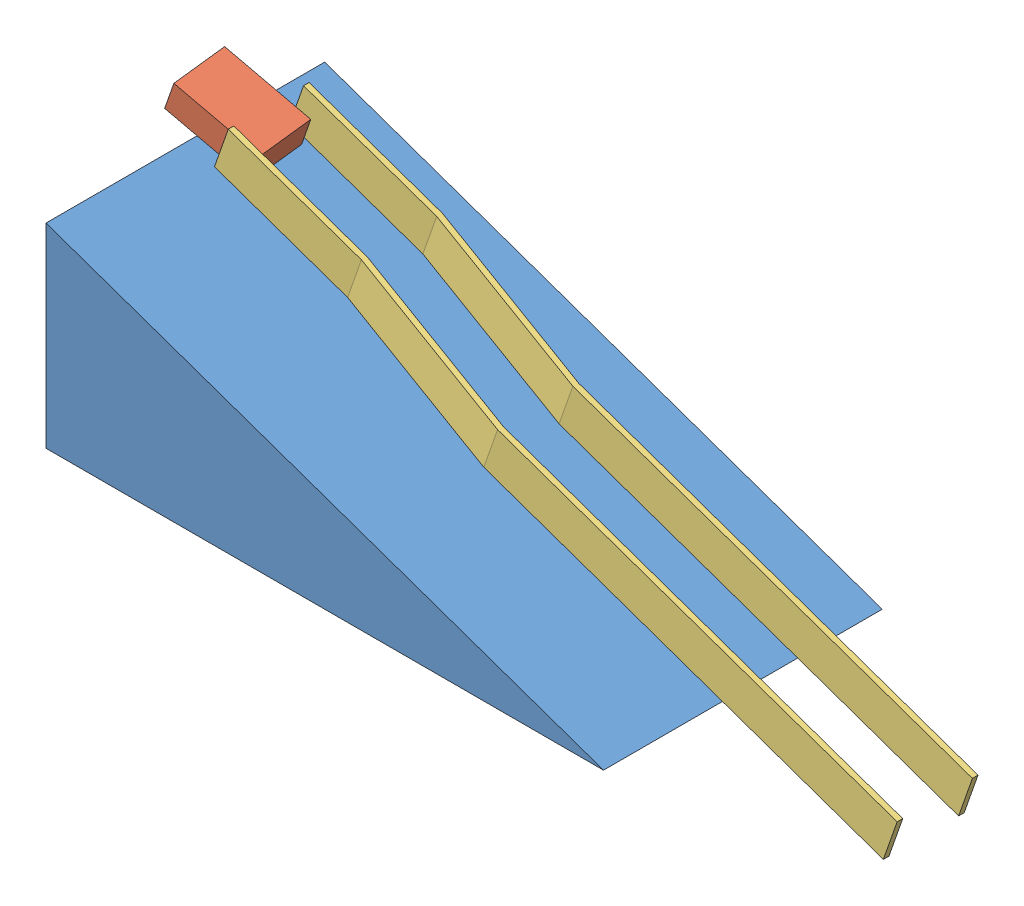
SolidWorks assembly schiefe-ebene.SLDASM, configuration mit-schiene (file format 4700). Lengths in mm.
Overall size (275 103.95 100).
4 component instances, 3 part files, 7 mates.
Components (placement in the parent):
- schiefe-ebene-1: schiefe-ebene.SLDPRT [_Standard] at origin size (200 70 100)
- klotz-1: klotz.SLDPRT [_Standard] at (-11.4689 74.0141 36.8566) x (0.94001 -0.329004 -0.09021) z (0.085145 -0.029801 0.995923) size (30 10 20)
- schiene-1: schiene.SLDPRT [_Standard] at (78.9501 42.3675 33.3121) x (0.943858 -0.33035 0) z (0 0 1) size (263.05 15 10.32)
- schiene-2: schiene.SLDPRT [_Standard] at (78.9501 42.3675 60.3121) x (0.943858 -0.33035 0) z (0 0 1) size (263.05 15 10.32)
Mates (geometry in assembly coordinates):
- Deckungsgleich11: coincident: plane of schiefe-ebene-1 through (0 70 100) normal (0.33035 0.943858 0); plane of klotz-1 through (438.8125 -83.594 55.2664) normal (-0.330464 -0.943819 0.000178)
- Deckungsgleich22: coincident: plane of schiefe-ebene-1 through (0 70 100) normal (0.33035 0.943858 0); plane of schiene-1 through (257.7196 -20.2018 30.321) normal (-0.33035 -0.943858 0)
- Abstand3: distance = 20 mm: plane of schiene-1 through (14.3938 80.8544 20) normal (0 0 -1); plane of schiefe-ebene-1 through (0 0 0) normal (0 0 -1)
- Deckungsgleich25: coincident: plane of schiefe-ebene-1 through (0 70 100) normal (0.33035 0.943858 0); plane of schiene-2 through (257.7196 -20.2018 57.321) normal (-0.33035 -0.943858 0)
- Abstand4: distance = 25 mm: plane of schiene-2 through (119.3279 44.1275 55.321) normal (0 0 -1); plane of schiene-1 through (119.3279 44.1275 30.321) normal (0 0 1)
- Abstand5: distance = 10 mm: plane of schiene-1 through (14.3938 80.8544 22) normal (-0.943858 0.33035 0); line of schiefe-ebene-1 through (0 70 100) axis (0 0 -1)
- Deckungsgleich29: coincident: plane of schiene-1 through (14.3938 80.8544 22) normal (-0.943858 0.33035 0); plane of schiene-2 through (14.3938 80.8544 49) normal (-0.943858 0.33035 0)
